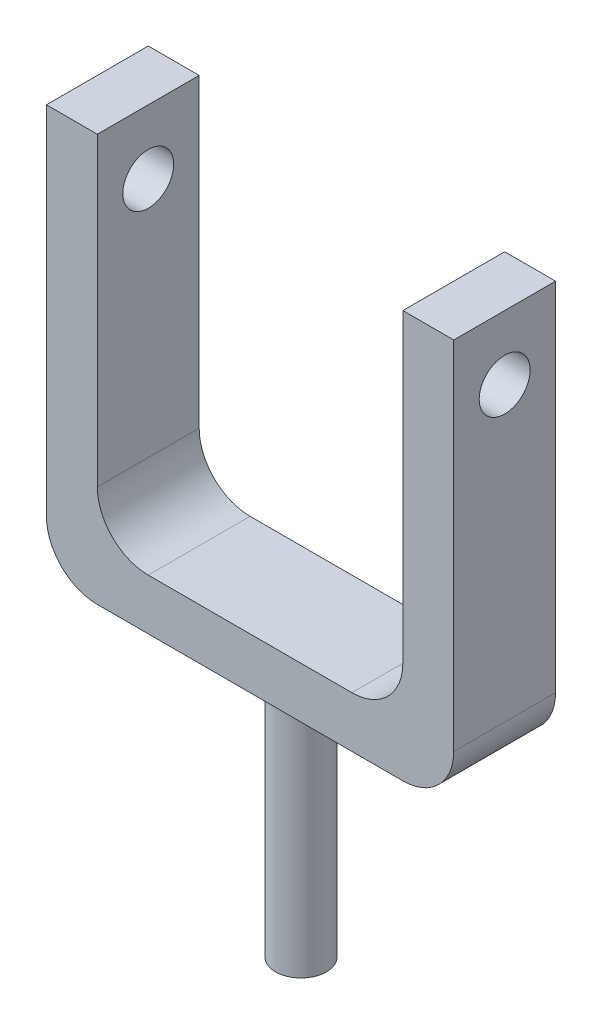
ISO-10303-21;
HEADER;
FILE_DESCRIPTION(('STEP AP214'),'2;1');
FILE_NAME('part.step','',(''),(''),'','','');
FILE_SCHEMA(('AUTOMOTIVE_DESIGN { 1 0 10303 214 1 1 1 1 }'));
ENDSEC;
DATA;
#1=APPLICATION_CONTEXT('core data for automotive mechanical design processes');
#2=APPLICATION_PROTOCOL_DEFINITION('international standard','automotive_design',2000,#1);
#3=PRODUCT_CONTEXT('',#1,'mechanical');
#4=PRODUCT('Part','Part','',(#3));
#5=PRODUCT_RELATED_PRODUCT_CATEGORY('part','',(#4));
#6=PRODUCT_DEFINITION_FORMATION('','',#4);
#7=PRODUCT_DEFINITION_CONTEXT('part definition',#1,'design');
#8=PRODUCT_DEFINITION('design','',#6,#7);
#9=PRODUCT_DEFINITION_SHAPE('','',#8);
#10=(LENGTH_UNIT() NAMED_UNIT(*) SI_UNIT(.MILLI.,.METRE.));
#11=(NAMED_UNIT(*) PLANE_ANGLE_UNIT() SI_UNIT($,.RADIAN.));
#12=(NAMED_UNIT(*) SI_UNIT($,.STERADIAN.) SOLID_ANGLE_UNIT());
#13=UNCERTAINTY_MEASURE_WITH_UNIT(LENGTH_MEASURE(1.E-05),#10,'distance_accuracy_value','');
#14=(GEOMETRIC_REPRESENTATION_CONTEXT(3) GLOBAL_UNCERTAINTY_ASSIGNED_CONTEXT((#13)) GLOBAL_UNIT_ASSIGNED_CONTEXT((#10,
#11,#12)) REPRESENTATION_CONTEXT('',''));
#15=CARTESIAN_POINT('',(0.,0.,0.));
#16=DIRECTION('',(0.,0.,1.));
#17=DIRECTION('',(1.,0.,0.));
#18=AXIS2_PLACEMENT_3D('',#15,#16,#17);
#19=CARTESIAN_POINT('',(-25.4,25.4,12.7));
#20=DIRECTION('',(0.,0.,-1.));
#21=DIRECTION('',(-1.,0.,0.));
#22=AXIS2_PLACEMENT_3D('',#19,#20,#21);
#23=CYLINDRICAL_SURFACE('',#22,12.7);
#24=CARTESIAN_POINT('',(-25.4,25.4,-12.7));
#25=DIRECTION('',(0.,0.,-1.));
#26=DIRECTION('',(1.,0.,0.));
#27=AXIS2_PLACEMENT_3D('',#24,#25,#26);
#28=CIRCLE('',#27,12.7);
#29=CARTESIAN_POINT('',(-25.4,12.7,-12.7));
#30=VERTEX_POINT('',#29);
#31=CARTESIAN_POINT('',(-38.1,25.4,-12.7));
#32=VERTEX_POINT('',#31);
#33=EDGE_CURVE('E160',#30,#32,#28,.T.);
#34=ORIENTED_EDGE('',*,*,#33,.T.);
#35=DIRECTION('',(0.,0.,-1.));
#36=VECTOR('',#35,1.);
#37=CARTESIAN_POINT('',(-38.1,25.4,12.7));
#38=LINE('',#37,#36);
#39=CARTESIAN_POINT('',(-38.1,25.4,12.7));
#40=VERTEX_POINT('',#39);
#41=EDGE_CURVE('E11',#40,#32,#38,.T.);
#42=ORIENTED_EDGE('',*,*,#41,.F.);
#43=CARTESIAN_POINT('',(-25.4,25.4,12.7));
#44=DIRECTION('',(0.,0.,-1.));
#45=DIRECTION('',(1.,0.,0.));
#46=AXIS2_PLACEMENT_3D('',#43,#44,#45);
#47=CIRCLE('',#46,12.7);
#48=CARTESIAN_POINT('',(-25.4,12.7,12.7));
#49=VERTEX_POINT('',#48);
#50=EDGE_CURVE('E183',#49,#40,#47,.T.);
#51=ORIENTED_EDGE('',*,*,#50,.F.);
#52=DIRECTION('',(0.,0.,-1.));
#53=VECTOR('',#52,1.);
#54=CARTESIAN_POINT('',(-25.4,12.7,12.7));
#55=LINE('',#54,#53);
#56=EDGE_CURVE('E156',#49,#30,#55,.T.);
#57=ORIENTED_EDGE('',*,*,#56,.T.);
#58=EDGE_LOOP('',(#34,#42,#51,#57));
#59=FACE_BOUND('',#58,.T.);
#60=ADVANCED_FACE('F39',(#59),#23,.F.);
#61=CARTESIAN_POINT('',(-38.1,25.4,12.7));
#62=DIRECTION('',(-1.,0.,0.));
#63=DIRECTION('',(0.,-1.,0.));
#64=AXIS2_PLACEMENT_3D('',#61,#62,#63);
#65=PLANE('',#64);
#66=CARTESIAN_POINT('',(-38.1,85.598,0.));
#67=DIRECTION('',(-1.,0.,0.));
#68=DIRECTION('',(0.,-1.,0.));
#69=AXIS2_PLACEMENT_3D('',#66,#67,#68);
#70=CIRCLE('',#69,6.35);
#71=CARTESIAN_POINT('',(-38.1,79.248,0.));
#72=VERTEX_POINT('',#71);
#73=EDGE_CURVE('E297',#72,#72,#70,.T.);
#74=ORIENTED_EDGE('',*,*,#73,.T.);
#75=EDGE_LOOP('',(#74));
#76=FACE_BOUND('',#75,.T.);
#77=DIRECTION('',(0.,1.,0.));
#78=VECTOR('',#77,1.);
#79=CARTESIAN_POINT('',(-38.1,25.4,-12.7));
#80=LINE('',#79,#78);
#81=CARTESIAN_POINT('',(-38.1,101.6,-12.7));
#82=VERTEX_POINT('',#81);
#83=EDGE_CURVE('E163',#32,#82,#80,.T.);
#84=ORIENTED_EDGE('',*,*,#83,.T.);
#85=DIRECTION('',(0.,0.,-1.));
#86=VECTOR('',#85,1.);
#87=CARTESIAN_POINT('',(-38.1,101.6,12.7));
#88=LINE('',#87,#86);
#89=CARTESIAN_POINT('',(-38.1,101.6,12.7));
#90=VERTEX_POINT('',#89);
#91=EDGE_CURVE('E48',#90,#82,#88,.T.);
#92=ORIENTED_EDGE('',*,*,#91,.F.);
#93=DIRECTION('',(0.,1.,0.));
#94=VECTOR('',#93,1.);
#95=CARTESIAN_POINT('',(-38.1,25.4,12.7));
#96=LINE('',#95,#94);
#97=EDGE_CURVE('E111',#40,#90,#96,.T.);
#98=ORIENTED_EDGE('',*,*,#97,.F.);
#99=ORIENTED_EDGE('',*,*,#41,.T.);
#100=EDGE_LOOP('',(#84,#92,#98,#99));
#101=FACE_BOUND('',#100,.T.);
#102=ADVANCED_FACE('F263',(#76,#101),#65,.F.);
#103=CARTESIAN_POINT('',(-38.1,101.6,12.7));
#104=DIRECTION('',(0.,-1.,0.));
#105=DIRECTION('',(1.,0.,0.));
#106=AXIS2_PLACEMENT_3D('',#103,#104,#105);
#107=PLANE('',#106);
#108=DIRECTION('',(-1.,0.,0.));
#109=VECTOR('',#108,1.);
#110=CARTESIAN_POINT('',(-38.1,101.6,-12.7));
#111=LINE('',#110,#109);
#112=CARTESIAN_POINT('',(-50.8,101.6,-12.7));
#113=VERTEX_POINT('',#112);
#114=EDGE_CURVE('E166',#82,#113,#111,.T.);
#115=ORIENTED_EDGE('',*,*,#114,.T.);
#116=DIRECTION('',(0.,0.,-1.));
#117=VECTOR('',#116,1.);
#118=CARTESIAN_POINT('',(-50.8,101.6,12.7));
#119=LINE('',#118,#117);
#120=CARTESIAN_POINT('',(-50.8,101.6,12.7));
#121=VERTEX_POINT('',#120);
#122=EDGE_CURVE('E202',#121,#113,#119,.T.);
#123=ORIENTED_EDGE('',*,*,#122,.F.);
#124=DIRECTION('',(-1.,0.,0.));
#125=VECTOR('',#124,1.);
#126=CARTESIAN_POINT('',(-38.1,101.6,12.7));
#127=LINE('',#126,#125);
#128=EDGE_CURVE('E211',#90,#121,#127,.T.);
#129=ORIENTED_EDGE('',*,*,#128,.F.);
#130=ORIENTED_EDGE('',*,*,#91,.T.);
#131=EDGE_LOOP('',(#115,#123,#129,#130));
#132=FACE_BOUND('',#131,.T.);
#133=ADVANCED_FACE('F209',(#132),#107,.F.);
#134=CARTESIAN_POINT('',(-50.8,101.6,12.7));
#135=DIRECTION('',(1.,0.,0.));
#136=DIRECTION('',(0.,0.,-1.));
#137=AXIS2_PLACEMENT_3D('',#134,#135,#136);
#138=PLANE('',#137);
#139=CARTESIAN_POINT('',(-50.8,85.598,0.));
#140=DIRECTION('',(1.,0.,0.));
#141=DIRECTION('',(0.,0.,-1.));
#142=AXIS2_PLACEMENT_3D('',#139,#140,#141);
#143=CIRCLE('',#142,6.35);
#144=CARTESIAN_POINT('',(-50.8,85.598,-6.35));
#145=VERTEX_POINT('',#144);
#146=EDGE_CURVE('E298',#145,#145,#143,.F.);
#147=ORIENTED_EDGE('',*,*,#146,.F.);
#148=EDGE_LOOP('',(#147));
#149=FACE_BOUND('',#148,.T.);
#150=DIRECTION('',(0.,-1.,0.));
#151=VECTOR('',#150,1.);
#152=CARTESIAN_POINT('',(-50.8,101.6,-12.7));
#153=LINE('',#152,#151);
#154=CARTESIAN_POINT('',(-50.8,12.7,-12.7));
#155=VERTEX_POINT('',#154);
#156=EDGE_CURVE('E168',#113,#155,#153,.T.);
#157=ORIENTED_EDGE('',*,*,#156,.T.);
#158=DIRECTION('',(0.,0.,-1.));
#159=VECTOR('',#158,1.);
#160=CARTESIAN_POINT('',(-50.8,12.7,12.7));
#161=LINE('',#160,#159);
#162=CARTESIAN_POINT('',(-50.8,12.7,12.7));
#163=VERTEX_POINT('',#162);
#164=EDGE_CURVE('E199',#163,#155,#161,.T.);
#165=ORIENTED_EDGE('',*,*,#164,.F.);
#166=DIRECTION('',(0.,-1.,0.));
#167=VECTOR('',#166,1.);
#168=CARTESIAN_POINT('',(-50.8,101.6,12.7));
#169=LINE('',#168,#167);
#170=EDGE_CURVE('E229',#121,#163,#169,.T.);
#171=ORIENTED_EDGE('',*,*,#170,.F.);
#172=ORIENTED_EDGE('',*,*,#122,.T.);
#173=EDGE_LOOP('',(#157,#165,#171,#172));
#174=FACE_BOUND('',#173,.T.);
#175=ADVANCED_FACE('F220',(#149,#174),#138,.F.);
#176=CARTESIAN_POINT('',(-38.1,12.7,12.7));
#177=DIRECTION('',(0.,0.,-1.));
#178=DIRECTION('',(-1.,0.,0.));
#179=AXIS2_PLACEMENT_3D('',#176,#177,#178);
#180=CYLINDRICAL_SURFACE('',#179,12.7);
#181=CARTESIAN_POINT('',(-38.1,12.7,-12.7));
#182=DIRECTION('',(0.,0.,1.));
#183=DIRECTION('',(1.,0.,0.));
#184=AXIS2_PLACEMENT_3D('',#181,#182,#183);
#185=CIRCLE('',#184,12.7);
#186=CARTESIAN_POINT('',(-38.1,0.,-12.7));
#187=VERTEX_POINT('',#186);
#188=EDGE_CURVE('E170',#155,#187,#185,.T.);
#189=ORIENTED_EDGE('',*,*,#188,.T.);
#190=DIRECTION('',(0.,0.,-1.));
#191=VECTOR('',#190,1.);
#192=CARTESIAN_POINT('',(-38.1,0.,12.7));
#193=LINE('',#192,#191);
#194=CARTESIAN_POINT('',(-38.1,0.,12.7));
#195=VERTEX_POINT('',#194);
#196=EDGE_CURVE('E196',#195,#187,#193,.T.);
#197=ORIENTED_EDGE('',*,*,#196,.F.);
#198=CARTESIAN_POINT('',(-38.1,12.7,12.7));
#199=DIRECTION('',(0.,0.,1.));
#200=DIRECTION('',(1.,0.,0.));
#201=AXIS2_PLACEMENT_3D('',#198,#199,#200);
#202=CIRCLE('',#201,12.7);
#203=EDGE_CURVE('E226',#163,#195,#202,.T.);
#204=ORIENTED_EDGE('',*,*,#203,.F.);
#205=ORIENTED_EDGE('',*,*,#164,.T.);
#206=EDGE_LOOP('',(#189,#197,#204,#205));
#207=FACE_BOUND('',#206,.T.);
#208=ADVANCED_FACE('F224',(#207),#180,.T.);
#209=CARTESIAN_POINT('',(-38.1,0.,12.7));
#210=DIRECTION('',(0.,1.,0.));
#211=DIRECTION('',(0.,0.,1.));
#212=AXIS2_PLACEMENT_3D('',#209,#210,#211);
#213=PLANE('',#212);
#214=CARTESIAN_POINT('',(0.,0.,0.));
#215=DIRECTION('',(0.,1.,0.));
#216=DIRECTION('',(0.,0.,1.));
#217=AXIS2_PLACEMENT_3D('',#214,#215,#216);
#218=CIRCLE('',#217,6.35);
#219=CARTESIAN_POINT('',(0.,0.,6.35));
#220=VERTEX_POINT('',#219);
#221=EDGE_CURVE('E299',#220,#220,#218,.T.);
#222=ORIENTED_EDGE('',*,*,#221,.T.);
#223=EDGE_LOOP('',(#222));
#224=FACE_BOUND('',#223,.T.);
#225=DIRECTION('',(1.,0.,0.));
#226=VECTOR('',#225,1.);
#227=CARTESIAN_POINT('',(-38.1,0.,-12.7));
#228=LINE('',#227,#226);
#229=CARTESIAN_POINT('',(38.1,0.,-12.7));
#230=VERTEX_POINT('',#229);
#231=EDGE_CURVE('E172',#187,#230,#228,.T.);
#232=ORIENTED_EDGE('',*,*,#231,.T.);
#233=DIRECTION('',(0.,0.,-1.));
#234=VECTOR('',#233,1.);
#235=CARTESIAN_POINT('',(38.1,0.,12.7));
#236=LINE('',#235,#234);
#237=CARTESIAN_POINT('',(38.1,0.,12.7));
#238=VERTEX_POINT('',#237);
#239=EDGE_CURVE('E193',#238,#230,#236,.T.);
#240=ORIENTED_EDGE('',*,*,#239,.F.);
#241=DIRECTION('',(1.,0.,0.));
#242=VECTOR('',#241,1.);
#243=CARTESIAN_POINT('',(-38.1,0.,12.7));
#244=LINE('',#243,#242);
#245=EDGE_CURVE('E228',#195,#238,#244,.T.);
#246=ORIENTED_EDGE('',*,*,#245,.F.);
#247=ORIENTED_EDGE('',*,*,#196,.T.);
#248=EDGE_LOOP('',(#232,#240,#246,#247));
#249=FACE_BOUND('',#248,.T.);
#250=ADVANCED_FACE('F279',(#224,#249),#213,.F.);
#251=CARTESIAN_POINT('',(38.1,12.7,12.7));
#252=DIRECTION('',(0.,0.,-1.));
#253=DIRECTION('',(-1.,0.,0.));
#254=AXIS2_PLACEMENT_3D('',#251,#252,#253);
#255=CYLINDRICAL_SURFACE('',#254,12.7);
#256=CARTESIAN_POINT('',(38.1,12.7,-12.7));
#257=DIRECTION('',(0.,0.,1.));
#258=DIRECTION('',(-1.,0.,0.));
#259=AXIS2_PLACEMENT_3D('',#256,#257,#258);
#260=CIRCLE('',#259,12.7);
#261=CARTESIAN_POINT('',(50.8,12.7,-12.7));
#262=VERTEX_POINT('',#261);
#263=EDGE_CURVE('E174',#230,#262,#260,.T.);
#264=ORIENTED_EDGE('',*,*,#263,.T.);
#265=DIRECTION('',(0.,0.,-1.));
#266=VECTOR('',#265,1.);
#267=CARTESIAN_POINT('',(50.8,12.7,12.7));
#268=LINE('',#267,#266);
#269=CARTESIAN_POINT('',(50.8,12.7,12.7));
#270=VERTEX_POINT('',#269);
#271=EDGE_CURVE('E190',#270,#262,#268,.T.);
#272=ORIENTED_EDGE('',*,*,#271,.F.);
#273=CARTESIAN_POINT('',(38.1,12.7,12.7));
#274=DIRECTION('',(0.,0.,1.));
#275=DIRECTION('',(-1.,0.,0.));
#276=AXIS2_PLACEMENT_3D('',#273,#274,#275);
#277=CIRCLE('',#276,12.7);
#278=EDGE_CURVE('E231',#238,#270,#277,.T.);
#279=ORIENTED_EDGE('',*,*,#278,.F.);
#280=ORIENTED_EDGE('',*,*,#239,.T.);
#281=EDGE_LOOP('',(#264,#272,#279,#280));
#282=FACE_BOUND('',#281,.T.);
#283=ADVANCED_FACE('F282',(#282),#255,.T.);
#284=CARTESIAN_POINT('',(50.8,12.7,12.7));
#285=DIRECTION('',(-1.,0.,0.));
#286=DIRECTION('',(0.,0.,1.));
#287=AXIS2_PLACEMENT_3D('',#284,#285,#286);
#288=PLANE('',#287);
#289=CARTESIAN_POINT('',(50.8,85.598,0.));
#290=DIRECTION('',(-1.,0.,0.));
#291=DIRECTION('',(0.,0.,1.));
#292=AXIS2_PLACEMENT_3D('',#289,#290,#291);
#293=CIRCLE('',#292,6.35);
#294=CARTESIAN_POINT('',(50.8,85.598,6.35));
#295=VERTEX_POINT('',#294);
#296=EDGE_CURVE('E302',#295,#295,#293,.T.);
#297=ORIENTED_EDGE('',*,*,#296,.T.);
#298=EDGE_LOOP('',(#297));
#299=FACE_BOUND('',#298,.T.);
#300=DIRECTION('',(0.,1.,0.));
#301=VECTOR('',#300,1.);
#302=CARTESIAN_POINT('',(50.8,12.7,-12.7));
#303=LINE('',#302,#301);
#304=CARTESIAN_POINT('',(50.8,101.6,-12.7));
#305=VERTEX_POINT('',#304);
#306=EDGE_CURVE('E176',#262,#305,#303,.T.);
#307=ORIENTED_EDGE('',*,*,#306,.T.);
#308=DIRECTION('',(0.,0.,-1.));
#309=VECTOR('',#308,1.);
#310=CARTESIAN_POINT('',(50.8,101.6,12.7));
#311=LINE('',#310,#309);
#312=CARTESIAN_POINT('',(50.8,101.6,12.7));
#313=VERTEX_POINT('',#312);
#314=EDGE_CURVE('E187',#313,#305,#311,.T.);
#315=ORIENTED_EDGE('',*,*,#314,.F.);
#316=DIRECTION('',(0.,1.,0.));
#317=VECTOR('',#316,1.);
#318=CARTESIAN_POINT('',(50.8,12.7,12.7));
#319=LINE('',#318,#317);
#320=EDGE_CURVE('E237',#270,#313,#319,.T.);
#321=ORIENTED_EDGE('',*,*,#320,.F.);
#322=ORIENTED_EDGE('',*,*,#271,.T.);
#323=EDGE_LOOP('',(#307,#315,#321,#322));
#324=FACE_BOUND('',#323,.T.);
#325=ADVANCED_FACE('F243',(#299,#324),#288,.F.);
#326=CARTESIAN_POINT('',(50.8,101.6,12.7));
#327=DIRECTION('',(0.,-1.,0.));
#328=DIRECTION('',(1.,0.,0.));
#329=AXIS2_PLACEMENT_3D('',#326,#327,#328);
#330=PLANE('',#329);
#331=DIRECTION('',(-1.,0.,0.));
#332=VECTOR('',#331,1.);
#333=CARTESIAN_POINT('',(50.8,101.6,-12.7));
#334=LINE('',#333,#332);
#335=CARTESIAN_POINT('',(38.1,101.6,-12.7));
#336=VERTEX_POINT('',#335);
#337=EDGE_CURVE('E178',#305,#336,#334,.T.);
#338=ORIENTED_EDGE('',*,*,#337,.T.);
#339=DIRECTION('',(0.,0.,-1.));
#340=VECTOR('',#339,1.);
#341=CARTESIAN_POINT('',(38.1,101.6,12.7));
#342=LINE('',#341,#340);
#343=CARTESIAN_POINT('',(38.1,101.6,12.7));
#344=VERTEX_POINT('',#343);
#345=EDGE_CURVE('E151',#344,#336,#342,.T.);
#346=ORIENTED_EDGE('',*,*,#345,.F.);
#347=DIRECTION('',(-1.,0.,0.));
#348=VECTOR('',#347,1.);
#349=CARTESIAN_POINT('',(50.8,101.6,12.7));
#350=LINE('',#349,#348);
#351=EDGE_CURVE('E142',#313,#344,#350,.T.);
#352=ORIENTED_EDGE('',*,*,#351,.F.);
#353=ORIENTED_EDGE('',*,*,#314,.T.);
#354=EDGE_LOOP('',(#338,#346,#352,#353));
#355=FACE_BOUND('',#354,.T.);
#356=ADVANCED_FACE('F247',(#355),#330,.F.);
#357=CARTESIAN_POINT('',(38.1,101.6,12.7));
#358=DIRECTION('',(1.,0.,0.));
#359=DIRECTION('',(0.,1.,0.));
#360=AXIS2_PLACEMENT_3D('',#357,#358,#359);
#361=PLANE('',#360);
#362=CARTESIAN_POINT('',(38.1,85.598,0.));
#363=DIRECTION('',(1.,0.,0.));
#364=DIRECTION('',(0.,1.,0.));
#365=AXIS2_PLACEMENT_3D('',#362,#363,#364);
#366=CIRCLE('',#365,6.35);
#367=CARTESIAN_POINT('',(38.1,91.948,0.));
#368=VERTEX_POINT('',#367);
#369=EDGE_CURVE('E42',#368,#368,#366,.T.);
#370=ORIENTED_EDGE('',*,*,#369,.T.);
#371=EDGE_LOOP('',(#370));
#372=FACE_BOUND('',#371,.T.);
#373=DIRECTION('',(0.,-1.,0.));
#374=VECTOR('',#373,1.);
#375=CARTESIAN_POINT('',(38.1,101.6,-12.7));
#376=LINE('',#375,#374);
#377=CARTESIAN_POINT('',(38.1,25.4,-12.7));
#378=VERTEX_POINT('',#377);
#379=EDGE_CURVE('E150',#336,#378,#376,.T.);
#380=ORIENTED_EDGE('',*,*,#379,.T.);
#381=DIRECTION('',(0.,0.,-1.));
#382=VECTOR('',#381,1.);
#383=CARTESIAN_POINT('',(38.1,25.4,12.7));
#384=LINE('',#383,#382);
#385=CARTESIAN_POINT('',(38.1,25.4,12.7));
#386=VERTEX_POINT('',#385);
#387=EDGE_CURVE('E147',#386,#378,#384,.T.);
#388=ORIENTED_EDGE('',*,*,#387,.F.);
#389=DIRECTION('',(0.,-1.,0.));
#390=VECTOR('',#389,1.);
#391=CARTESIAN_POINT('',(38.1,101.6,12.7));
#392=LINE('',#391,#390);
#393=EDGE_CURVE('E136',#344,#386,#392,.T.);
#394=ORIENTED_EDGE('',*,*,#393,.F.);
#395=ORIENTED_EDGE('',*,*,#345,.T.);
#396=EDGE_LOOP('',(#380,#388,#394,#395));
#397=FACE_BOUND('',#396,.T.);
#398=ADVANCED_FACE('F148',(#372,#397),#361,.F.);
#399=CARTESIAN_POINT('',(25.4,25.4,12.7));
#400=DIRECTION('',(0.,0.,-1.));
#401=DIRECTION('',(-1.,0.,0.));
#402=AXIS2_PLACEMENT_3D('',#399,#400,#401);
#403=CYLINDRICAL_SURFACE('',#402,12.7);
#404=CARTESIAN_POINT('',(25.4,25.4,-12.7));
#405=DIRECTION('',(0.,0.,-1.));
#406=DIRECTION('',(-1.,0.,0.));
#407=AXIS2_PLACEMENT_3D('',#404,#405,#406);
#408=CIRCLE('',#407,12.7);
#409=CARTESIAN_POINT('',(25.4,12.7,-12.7));
#410=VERTEX_POINT('',#409);
#411=EDGE_CURVE('E97',#378,#410,#408,.T.);
#412=ORIENTED_EDGE('',*,*,#411,.T.);
#413=DIRECTION('',(0.,0.,-1.));
#414=VECTOR('',#413,1.);
#415=CARTESIAN_POINT('',(25.4,12.7,12.7));
#416=LINE('',#415,#414);
#417=CARTESIAN_POINT('',(25.4,12.7,12.7));
#418=VERTEX_POINT('',#417);
#419=EDGE_CURVE('E152',#418,#410,#416,.T.);
#420=ORIENTED_EDGE('',*,*,#419,.F.);
#421=CARTESIAN_POINT('',(25.4,25.4,12.7));
#422=DIRECTION('',(0.,0.,-1.));
#423=DIRECTION('',(-1.,0.,0.));
#424=AXIS2_PLACEMENT_3D('',#421,#422,#423);
#425=CIRCLE('',#424,12.7);
#426=EDGE_CURVE('E140',#386,#418,#425,.T.);
#427=ORIENTED_EDGE('',*,*,#426,.F.);
#428=ORIENTED_EDGE('',*,*,#387,.T.);
#429=EDGE_LOOP('',(#412,#420,#427,#428));
#430=FACE_BOUND('',#429,.T.);
#431=ADVANCED_FACE('F154',(#430),#403,.F.);
#432=CARTESIAN_POINT('',(25.4,12.7,12.7));
#433=DIRECTION('',(0.,-1.,0.));
#434=DIRECTION('',(1.,0.,0.));
#435=AXIS2_PLACEMENT_3D('',#432,#433,#434);
#436=PLANE('',#435);
#437=DIRECTION('',(-1.,0.,0.));
#438=VECTOR('',#437,1.);
#439=CARTESIAN_POINT('',(25.4,12.7,-12.7));
#440=LINE('',#439,#438);
#441=EDGE_CURVE('E103',#410,#30,#440,.T.);
#442=ORIENTED_EDGE('',*,*,#441,.T.);
#443=ORIENTED_EDGE('',*,*,#56,.F.);
#444=DIRECTION('',(-1.,0.,0.));
#445=VECTOR('',#444,1.);
#446=CARTESIAN_POINT('',(25.4,12.7,12.7));
#447=LINE('',#446,#445);
#448=EDGE_CURVE('E56',#418,#49,#447,.T.);
#449=ORIENTED_EDGE('',*,*,#448,.F.);
#450=ORIENTED_EDGE('',*,*,#419,.T.);
#451=EDGE_LOOP('',(#442,#443,#449,#450));
#452=FACE_BOUND('',#451,.T.);
#453=ADVANCED_FACE('F251',(#452),#436,.F.);
#454=CARTESIAN_POINT('',(-25.4,25.4,12.7));
#455=DIRECTION('',(0.,0.,1.));
#456=DIRECTION('',(1.,0.,0.));
#457=AXIS2_PLACEMENT_3D('',#454,#455,#456);
#458=PLANE('',#457);
#459=ORIENTED_EDGE('',*,*,#50,.T.);
#460=ORIENTED_EDGE('',*,*,#97,.T.);
#461=ORIENTED_EDGE('',*,*,#128,.T.);
#462=ORIENTED_EDGE('',*,*,#170,.T.);
#463=ORIENTED_EDGE('',*,*,#203,.T.);
#464=ORIENTED_EDGE('',*,*,#245,.T.);
#465=ORIENTED_EDGE('',*,*,#278,.T.);
#466=ORIENTED_EDGE('',*,*,#320,.T.);
#467=ORIENTED_EDGE('',*,*,#351,.T.);
#468=ORIENTED_EDGE('',*,*,#393,.T.);
#469=ORIENTED_EDGE('',*,*,#426,.T.);
#470=ORIENTED_EDGE('',*,*,#448,.T.);
#471=EDGE_LOOP('',(#459,#460,#461,#462,#463,#464,#465,#466,#467,#468,#469,#470));
#472=FACE_BOUND('',#471,.T.);
#473=ADVANCED_FACE('F138',(#472),#458,.T.);
#474=CARTESIAN_POINT('',(-25.4,25.4,-12.7));
#475=DIRECTION('',(0.,0.,1.));
#476=DIRECTION('',(1.,0.,0.));
#477=AXIS2_PLACEMENT_3D('',#474,#475,#476);
#478=PLANE('',#477);
#479=ORIENTED_EDGE('',*,*,#33,.F.);
#480=ORIENTED_EDGE('',*,*,#441,.F.);
#481=ORIENTED_EDGE('',*,*,#411,.F.);
#482=ORIENTED_EDGE('',*,*,#379,.F.);
#483=ORIENTED_EDGE('',*,*,#337,.F.);
#484=ORIENTED_EDGE('',*,*,#306,.F.);
#485=ORIENTED_EDGE('',*,*,#263,.F.);
#486=ORIENTED_EDGE('',*,*,#231,.F.);
#487=ORIENTED_EDGE('',*,*,#188,.F.);
#488=ORIENTED_EDGE('',*,*,#156,.F.);
#489=ORIENTED_EDGE('',*,*,#114,.F.);
#490=ORIENTED_EDGE('',*,*,#83,.F.);
#491=EDGE_LOOP('',(#479,#480,#481,#482,#483,#484,#485,#486,#487,#488,#489,#490));
#492=FACE_BOUND('',#491,.T.);
#493=ADVANCED_FACE('F215',(#492),#478,.F.);
#494=CARTESIAN_POINT('',(0.,-63.5,0.));
#495=DIRECTION('',(0.,1.,0.));
#496=DIRECTION('',(0.,0.,1.));
#497=AXIS2_PLACEMENT_3D('',#494,#495,#496);
#498=CYLINDRICAL_SURFACE('',#497,6.35);
#499=CARTESIAN_POINT('',(0.,-63.5,0.));
#500=DIRECTION('',(0.,1.,0.));
#501=DIRECTION('',(0.,0.,1.));
#502=AXIS2_PLACEMENT_3D('',#499,#500,#501);
#503=CIRCLE('',#502,6.35);
#504=CARTESIAN_POINT('',(0.,-63.5,6.35));
#505=VERTEX_POINT('',#504);
#506=EDGE_CURVE('E164',#505,#505,#503,.T.);
#507=ORIENTED_EDGE('',*,*,#506,.T.);
#508=EDGE_LOOP('',(#507));
#509=FACE_BOUND('',#508,.T.);
#510=ORIENTED_EDGE('',*,*,#221,.F.);
#511=EDGE_LOOP('',(#510));
#512=FACE_BOUND('',#511,.T.);
#513=ADVANCED_FACE('F317',(#509,#512),#498,.T.);
#514=CARTESIAN_POINT('',(0.,-63.5,0.));
#515=DIRECTION('',(0.,1.,0.));
#516=DIRECTION('',(0.,0.,1.));
#517=AXIS2_PLACEMENT_3D('',#514,#515,#516);
#518=PLANE('',#517);
#519=ORIENTED_EDGE('',*,*,#506,.F.);
#520=EDGE_LOOP('',(#519));
#521=FACE_BOUND('',#520,.T.);
#522=ADVANCED_FACE('F319',(#521),#518,.F.);
#523=CARTESIAN_POINT('',(-68.7605122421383,85.598,0.));
#524=DIRECTION('',(1.,0.,0.));
#525=DIRECTION('',(0.,0.,-1.));
#526=AXIS2_PLACEMENT_3D('',#523,#524,#525);
#527=CYLINDRICAL_SURFACE('',#526,6.35);
#528=ORIENTED_EDGE('',*,*,#296,.F.);
#529=EDGE_LOOP('',(#528));
#530=FACE_BOUND('',#529,.T.);
#531=ORIENTED_EDGE('',*,*,#369,.F.);
#532=EDGE_LOOP('',(#531));
#533=FACE_BOUND('',#532,.T.);
#534=ADVANCED_FACE('F326',(#530,#533),#527,.F.);
#535=ORIENTED_EDGE('',*,*,#146,.T.);
#536=EDGE_LOOP('',(#535));
#537=FACE_BOUND('',#536,.T.);
#538=ORIENTED_EDGE('',*,*,#73,.F.);
#539=EDGE_LOOP('',(#538));
#540=FACE_BOUND('',#539,.T.);
#541=ADVANCED_FACE('F331',(#537,#540),#527,.F.);
#542=CLOSED_SHELL('',(#60,#102,#133,#175,#208,#250,#283,#325,#356,#398,#431,#453,#473,#493,#513,
#522,#534,#541));
#543=MANIFOLD_SOLID_BREP('B2',#542);
#544=ADVANCED_BREP_SHAPE_REPRESENTATION('',(#18,#543),#14);
#545=SHAPE_DEFINITION_REPRESENTATION(#9,#544);
ENDSEC;
END-ISO-10303-21;
